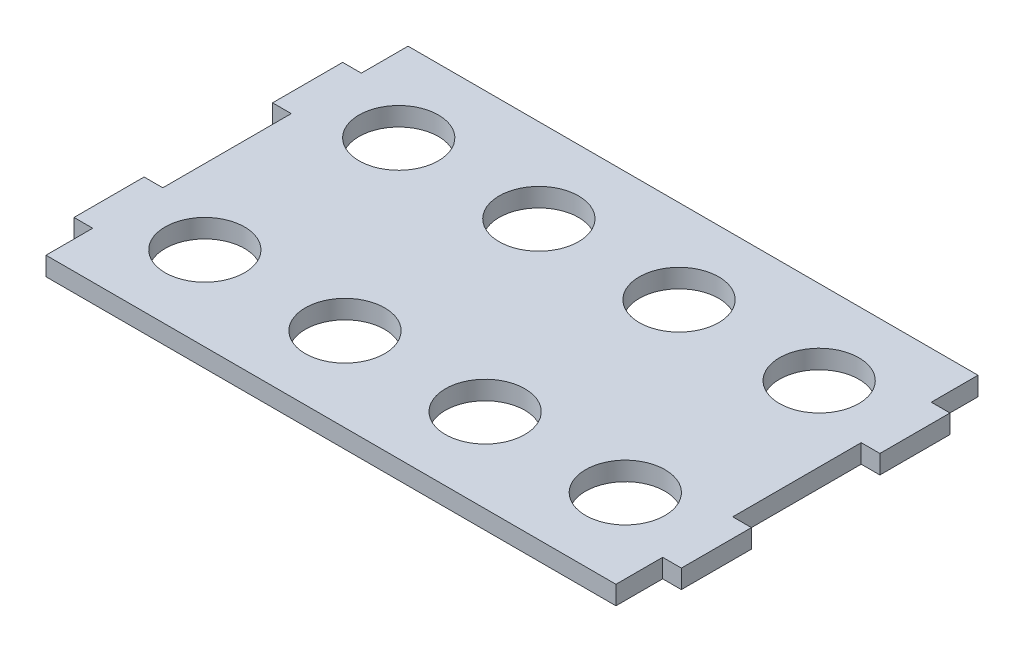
from build123d import *

# Parameters (mm, degrees)
SKIZZE2_R                       = 8.5
AUFSATZ_LINEAR_AUSTRAGEN1_DEPTH = 4


with BuildPart() as part:
    # Skizze2 → Aufsatz-Linear austragen1 (new body)
    with BuildSketch(Plane(origin=(0, 0, 0), x_dir=(1, 0, 0), z_dir=(0, 1, 0))):
        Polygon((-61, 38.75), (61, 38.75), (61, 28.75), (65, 28.75), (65, 13.75), (61, 13.75), (61, -13.75), (65, -13.75), (65, -28.75), (61, -28.75), (61, -38.75), (-61, -38.75), (-61, -28.75), (-65, -28.75), (-65, -13.75), (-61, -13.75), (-61, 13.75), (-65, 13.75), (-65, 28.75), (-61, 28.75), align=None)
        with Locations(Location((-45, -20.75, 0), (0, 0, 270))):
            Circle(SKIZZE2_R, mode=Mode.SUBTRACT)
        with Locations(Location((-15, -20.75, 0), (0, 0, 270))):
            Circle(SKIZZE2_R, mode=Mode.SUBTRACT)
        with Locations(Location((45, -20.75, 0), (0, 0, 90))):
            Circle(SKIZZE2_R, mode=Mode.SUBTRACT)
        with Locations(Location((15, -20.75, 0), (0, 0, 90))):
            Circle(SKIZZE2_R, mode=Mode.SUBTRACT)
        with Locations(Location((45, 20.75, 0), (0, 0, 270))):
            Circle(SKIZZE2_R, mode=Mode.SUBTRACT)
        with Locations(Location((15, 20.75, 0), (0, 0, 270))):
            Circle(SKIZZE2_R, mode=Mode.SUBTRACT)
        with Locations(Location((-15, 20.75, 0), (0, 0, 90))):
            Circle(SKIZZE2_R, mode=Mode.SUBTRACT)
        with Locations(Location((-45, 20.75, 0), (0, 0, 90))):
            Circle(SKIZZE2_R, mode=Mode.SUBTRACT)
    extrude(amount=AUFSATZ_LINEAR_AUSTRAGEN1_DEPTH)


solid = part.part
